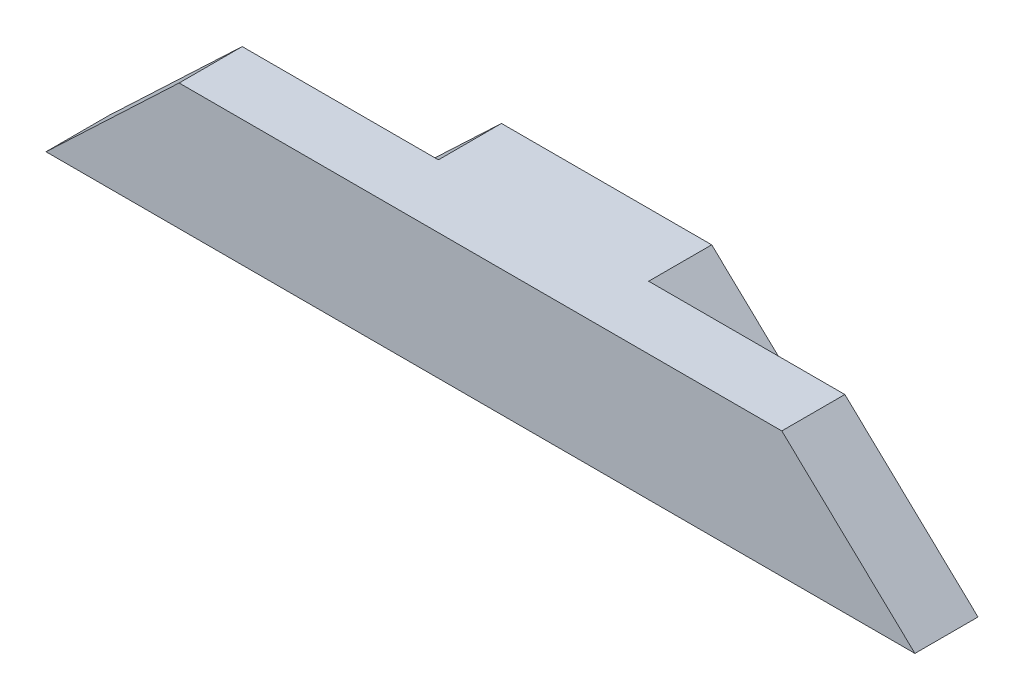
ISO-10303-21;
HEADER;
FILE_DESCRIPTION(('STEP AP214'),'2;1');
FILE_NAME('part.step','',(''),(''),'','','');
FILE_SCHEMA(('AUTOMOTIVE_DESIGN { 1 0 10303 214 1 1 1 1 }'));
ENDSEC;
DATA;
#1=APPLICATION_CONTEXT('core data for automotive mechanical design processes');
#2=APPLICATION_PROTOCOL_DEFINITION('international standard','automotive_design',2000,#1);
#3=PRODUCT_CONTEXT('',#1,'mechanical');
#4=PRODUCT('Part','Part','',(#3));
#5=PRODUCT_RELATED_PRODUCT_CATEGORY('part','',(#4));
#6=PRODUCT_DEFINITION_FORMATION('','',#4);
#7=PRODUCT_DEFINITION_CONTEXT('part definition',#1,'design');
#8=PRODUCT_DEFINITION('design','',#6,#7);
#9=PRODUCT_DEFINITION_SHAPE('','',#8);
#10=(LENGTH_UNIT() NAMED_UNIT(*) SI_UNIT(.MILLI.,.METRE.));
#11=(NAMED_UNIT(*) PLANE_ANGLE_UNIT() SI_UNIT($,.RADIAN.));
#12=(NAMED_UNIT(*) SI_UNIT($,.STERADIAN.) SOLID_ANGLE_UNIT());
#13=UNCERTAINTY_MEASURE_WITH_UNIT(LENGTH_MEASURE(1.E-05),#10,'distance_accuracy_value','');
#14=(GEOMETRIC_REPRESENTATION_CONTEXT(3) GLOBAL_UNCERTAINTY_ASSIGNED_CONTEXT((#13)) GLOBAL_UNIT_ASSIGNED_CONTEXT((#10,
#11,#12)) REPRESENTATION_CONTEXT('',''));
#15=CARTESIAN_POINT('',(0.,0.,0.));
#16=DIRECTION('',(0.,0.,1.));
#17=DIRECTION('',(1.,0.,0.));
#18=AXIS2_PLACEMENT_3D('',#15,#16,#17);
#19=CARTESIAN_POINT('',(9.5,9.,0.));
#20=DIRECTION('',(0.687744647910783,-0.725952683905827,0.));
#21=DIRECTION('',(0.725952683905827,0.687744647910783,0.));
#22=AXIS2_PLACEMENT_3D('',#19,#20,#21);
#23=PLANE('',#22);
#24=DIRECTION('',(0.725952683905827,0.687744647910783,0.));
#25=VECTOR('',#24,1.);
#26=CARTESIAN_POINT('',(0.,0.,4.5));
#27=LINE('',#26,#25);
#28=CARTESIAN_POINT('',(0.,0.,4.5));
#29=VERTEX_POINT('',#28);
#30=CARTESIAN_POINT('',(9.5,9.,4.5));
#31=VERTEX_POINT('',#30);
#32=EDGE_CURVE('E142',#29,#31,#27,.T.);
#33=ORIENTED_EDGE('',*,*,#32,.F.);
#34=DIRECTION('',(0.,0.,-1.));
#35=VECTOR('',#34,1.);
#36=CARTESIAN_POINT('',(0.,0.,9.));
#37=LINE('',#36,#35);
#38=CARTESIAN_POINT('',(0.,0.,9.));
#39=VERTEX_POINT('',#38);
#40=EDGE_CURVE('E11',#39,#29,#37,.T.);
#41=ORIENTED_EDGE('',*,*,#40,.F.);
#42=DIRECTION('',(0.725952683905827,0.687744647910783,0.));
#43=VECTOR('',#42,1.);
#44=CARTESIAN_POINT('',(9.5,9.,9.));
#45=LINE('',#44,#43);
#46=CARTESIAN_POINT('',(9.5,9.,9.));
#47=VERTEX_POINT('',#46);
#48=EDGE_CURVE('E131',#39,#47,#45,.T.);
#49=ORIENTED_EDGE('',*,*,#48,.T.);
#50=DIRECTION('',(0.,0.,1.));
#51=VECTOR('',#50,1.);
#52=CARTESIAN_POINT('',(9.5,9.,0.));
#53=LINE('',#52,#51);
#54=EDGE_CURVE('E129',#31,#47,#53,.T.);
#55=ORIENTED_EDGE('',*,*,#54,.F.);
#56=EDGE_LOOP('',(#33,#41,#49,#55));
#57=FACE_BOUND('',#56,.T.);
#58=ADVANCED_FACE('F30',(#57),#23,.F.);
#59=CARTESIAN_POINT('',(0.,0.,9.));
#60=DIRECTION('',(0.,1.,0.));
#61=DIRECTION('',(0.,0.,1.));
#62=AXIS2_PLACEMENT_3D('',#59,#60,#61);
#63=PLANE('',#62);
#64=DIRECTION('',(1.,0.,0.));
#65=VECTOR('',#64,1.);
#66=CARTESIAN_POINT('',(0.,0.,0.));
#67=LINE('',#66,#65);
#68=CARTESIAN_POINT('',(14.,0.,0.));
#69=VERTEX_POINT('',#68);
#70=CARTESIAN_POINT('',(48.,0.,0.));
#71=VERTEX_POINT('',#70);
#72=EDGE_CURVE('E123',#69,#71,#67,.T.);
#73=ORIENTED_EDGE('',*,*,#72,.T.);
#74=DIRECTION('',(0.,0.,-1.));
#75=VECTOR('',#74,1.);
#76=CARTESIAN_POINT('',(48.,0.,4.5));
#77=LINE('',#76,#75);
#78=CARTESIAN_POINT('',(48.,0.,4.5));
#79=VERTEX_POINT('',#78);
#80=EDGE_CURVE('E109',#79,#71,#77,.T.);
#81=ORIENTED_EDGE('',*,*,#80,.F.);
#82=DIRECTION('',(-1.,0.,0.));
#83=VECTOR('',#82,1.);
#84=CARTESIAN_POINT('',(48.,0.,4.5));
#85=LINE('',#84,#83);
#86=CARTESIAN_POINT('',(62.,0.,4.5));
#87=VERTEX_POINT('',#86);
#88=EDGE_CURVE('E98',#87,#79,#85,.T.);
#89=ORIENTED_EDGE('',*,*,#88,.F.);
#90=DIRECTION('',(0.,0.,-1.));
#91=VECTOR('',#90,1.);
#92=CARTESIAN_POINT('',(62.,0.,9.));
#93=LINE('',#92,#91);
#94=CARTESIAN_POINT('',(62.,0.,9.));
#95=VERTEX_POINT('',#94);
#96=EDGE_CURVE('E38',#95,#87,#93,.T.);
#97=ORIENTED_EDGE('',*,*,#96,.F.);
#98=DIRECTION('',(1.,0.,0.));
#99=VECTOR('',#98,1.);
#100=CARTESIAN_POINT('',(0.,0.,9.));
#101=LINE('',#100,#99);
#102=EDGE_CURVE('E118',#39,#95,#101,.T.);
#103=ORIENTED_EDGE('',*,*,#102,.F.);
#104=ORIENTED_EDGE('',*,*,#40,.T.);
#105=DIRECTION('',(-1.,0.,0.));
#106=VECTOR('',#105,1.);
#107=CARTESIAN_POINT('',(14.,0.,4.5));
#108=LINE('',#107,#106);
#109=CARTESIAN_POINT('',(14.,0.,4.5));
#110=VERTEX_POINT('',#109);
#111=EDGE_CURVE('E53',#110,#29,#108,.T.);
#112=ORIENTED_EDGE('',*,*,#111,.F.);
#113=DIRECTION('',(0.,0.,-1.));
#114=VECTOR('',#113,1.);
#115=CARTESIAN_POINT('',(14.,0.,4.5));
#116=LINE('',#115,#114);
#117=EDGE_CURVE('E134',#110,#69,#116,.T.);
#118=ORIENTED_EDGE('',*,*,#117,.T.);
#119=EDGE_LOOP('',(#73,#81,#89,#97,#103,#104,#112,#118));
#120=FACE_BOUND('',#119,.T.);
#121=ADVANCED_FACE('F32',(#120),#63,.F.);
#122=CARTESIAN_POINT('',(0.,9.,9.));
#123=DIRECTION('',(0.,-1.,0.));
#124=DIRECTION('',(0.,0.,-1.));
#125=AXIS2_PLACEMENT_3D('',#122,#123,#124);
#126=PLANE('',#125);
#127=DIRECTION('',(1.,0.,0.));
#128=VECTOR('',#127,1.);
#129=CARTESIAN_POINT('',(52.5,9.,4.5));
#130=LINE('',#129,#128);
#131=CARTESIAN_POINT('',(38.5,9.,4.5));
#132=VERTEX_POINT('',#131);
#133=CARTESIAN_POINT('',(52.5,9.,4.5));
#134=VERTEX_POINT('',#133);
#135=EDGE_CURVE('E45',#132,#134,#130,.T.);
#136=ORIENTED_EDGE('',*,*,#135,.F.);
#137=DIRECTION('',(0.,0.,-1.));
#138=VECTOR('',#137,1.);
#139=CARTESIAN_POINT('',(38.5,9.,4.5));
#140=LINE('',#139,#138);
#141=CARTESIAN_POINT('',(38.5,9.,0.));
#142=VERTEX_POINT('',#141);
#143=EDGE_CURVE('E143',#132,#142,#140,.T.);
#144=ORIENTED_EDGE('',*,*,#143,.T.);
#145=DIRECTION('',(-1.,0.,0.));
#146=VECTOR('',#145,1.);
#147=CARTESIAN_POINT('',(0.,9.,0.));
#148=LINE('',#147,#146);
#149=CARTESIAN_POINT('',(23.5,9.,0.));
#150=VERTEX_POINT('',#149);
#151=EDGE_CURVE('E121',#142,#150,#148,.T.);
#152=ORIENTED_EDGE('',*,*,#151,.T.);
#153=DIRECTION('',(0.,0.,-1.));
#154=VECTOR('',#153,1.);
#155=CARTESIAN_POINT('',(23.5,9.,4.5));
#156=LINE('',#155,#154);
#157=CARTESIAN_POINT('',(23.5,9.,4.5));
#158=VERTEX_POINT('',#157);
#159=EDGE_CURVE('E135',#158,#150,#156,.T.);
#160=ORIENTED_EDGE('',*,*,#159,.F.);
#161=DIRECTION('',(1.,0.,0.));
#162=VECTOR('',#161,1.);
#163=CARTESIAN_POINT('',(9.5,9.,4.5));
#164=LINE('',#163,#162);
#165=EDGE_CURVE('E147',#31,#158,#164,.T.);
#166=ORIENTED_EDGE('',*,*,#165,.F.);
#167=ORIENTED_EDGE('',*,*,#54,.T.);
#168=DIRECTION('',(-1.,0.,0.));
#169=VECTOR('',#168,1.);
#170=CARTESIAN_POINT('',(0.,9.,9.));
#171=LINE('',#170,#169);
#172=CARTESIAN_POINT('',(52.5,9.,9.));
#173=VERTEX_POINT('',#172);
#174=EDGE_CURVE('E116',#173,#47,#171,.T.);
#175=ORIENTED_EDGE('',*,*,#174,.F.);
#176=DIRECTION('',(0.,0.,1.));
#177=VECTOR('',#176,1.);
#178=CARTESIAN_POINT('',(52.5,9.,0.));
#179=LINE('',#178,#177);
#180=EDGE_CURVE('E124',#134,#173,#179,.T.);
#181=ORIENTED_EDGE('',*,*,#180,.F.);
#182=EDGE_LOOP('',(#136,#144,#152,#160,#166,#167,#175,#181));
#183=FACE_BOUND('',#182,.T.);
#184=ADVANCED_FACE('F158',(#183),#126,.F.);
#185=CARTESIAN_POINT('',(0.,9.,9.));
#186=DIRECTION('',(0.,0.,-1.));
#187=DIRECTION('',(-1.,0.,0.));
#188=AXIS2_PLACEMENT_3D('',#185,#186,#187);
#189=PLANE('',#188);
#190=ORIENTED_EDGE('',*,*,#174,.T.);
#191=ORIENTED_EDGE('',*,*,#48,.F.);
#192=ORIENTED_EDGE('',*,*,#102,.T.);
#193=DIRECTION('',(0.725952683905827,-0.687744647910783,0.));
#194=VECTOR('',#193,1.);
#195=CARTESIAN_POINT('',(52.5,9.,9.));
#196=LINE('',#195,#194);
#197=EDGE_CURVE('E114',#173,#95,#196,.T.);
#198=ORIENTED_EDGE('',*,*,#197,.F.);
#199=EDGE_LOOP('',(#190,#191,#192,#198));
#200=FACE_BOUND('',#199,.T.);
#201=ADVANCED_FACE('F162',(#200),#189,.F.);
#202=CARTESIAN_POINT('',(0.,9.,0.));
#203=DIRECTION('',(0.,0.,-1.));
#204=DIRECTION('',(-1.,0.,0.));
#205=AXIS2_PLACEMENT_3D('',#202,#203,#204);
#206=PLANE('',#205);
#207=DIRECTION('',(-0.725952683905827,0.687744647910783,0.));
#208=VECTOR('',#207,1.);
#209=CARTESIAN_POINT('',(38.5,9.,0.));
#210=LINE('',#209,#208);
#211=EDGE_CURVE('E103',#71,#142,#210,.T.);
#212=ORIENTED_EDGE('',*,*,#211,.F.);
#213=ORIENTED_EDGE('',*,*,#72,.F.);
#214=DIRECTION('',(-0.725952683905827,-0.687744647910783,0.));
#215=VECTOR('',#214,1.);
#216=CARTESIAN_POINT('',(23.5,9.,0.));
#217=LINE('',#216,#215);
#218=EDGE_CURVE('E140',#150,#69,#217,.T.);
#219=ORIENTED_EDGE('',*,*,#218,.F.);
#220=ORIENTED_EDGE('',*,*,#151,.F.);
#221=EDGE_LOOP('',(#212,#213,#219,#220));
#222=FACE_BOUND('',#221,.T.);
#223=ADVANCED_FACE('F175',(#222),#206,.T.);
#224=CARTESIAN_POINT('',(52.5,9.,0.));
#225=DIRECTION('',(-0.687744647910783,-0.725952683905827,0.));
#226=DIRECTION('',(0.725952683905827,-0.687744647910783,0.));
#227=AXIS2_PLACEMENT_3D('',#224,#225,#226);
#228=PLANE('',#227);
#229=ORIENTED_EDGE('',*,*,#96,.T.);
#230=DIRECTION('',(0.725952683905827,-0.687744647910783,0.));
#231=VECTOR('',#230,1.);
#232=CARTESIAN_POINT('',(62.,0.,4.5));
#233=LINE('',#232,#231);
#234=EDGE_CURVE('E95',#134,#87,#233,.T.);
#235=ORIENTED_EDGE('',*,*,#234,.F.);
#236=ORIENTED_EDGE('',*,*,#180,.T.);
#237=ORIENTED_EDGE('',*,*,#197,.T.);
#238=EDGE_LOOP('',(#229,#235,#236,#237));
#239=FACE_BOUND('',#238,.T.);
#240=ADVANCED_FACE('F112',(#239),#228,.F.);
#241=CARTESIAN_POINT('',(23.5,9.,4.5));
#242=DIRECTION('',(0.687744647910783,-0.725952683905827,0.));
#243=DIRECTION('',(0.725952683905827,0.687744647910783,0.));
#244=AXIS2_PLACEMENT_3D('',#241,#242,#243);
#245=PLANE('',#244);
#246=ORIENTED_EDGE('',*,*,#218,.T.);
#247=ORIENTED_EDGE('',*,*,#117,.F.);
#248=DIRECTION('',(-0.725952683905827,-0.687744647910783,0.));
#249=VECTOR('',#248,1.);
#250=CARTESIAN_POINT('',(23.5,9.,4.5));
#251=LINE('',#250,#249);
#252=EDGE_CURVE('E145',#158,#110,#251,.T.);
#253=ORIENTED_EDGE('',*,*,#252,.F.);
#254=ORIENTED_EDGE('',*,*,#159,.T.);
#255=EDGE_LOOP('',(#246,#247,#253,#254));
#256=FACE_BOUND('',#255,.T.);
#257=ADVANCED_FACE('F171',(#256),#245,.F.);
#258=CARTESIAN_POINT('',(9.50000000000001,9.,4.5));
#259=DIRECTION('',(0.,0.,-1.));
#260=DIRECTION('',(-1.,0.,0.));
#261=AXIS2_PLACEMENT_3D('',#258,#259,#260);
#262=PLANE('',#261);
#263=ORIENTED_EDGE('',*,*,#32,.T.);
#264=ORIENTED_EDGE('',*,*,#165,.T.);
#265=ORIENTED_EDGE('',*,*,#252,.T.);
#266=ORIENTED_EDGE('',*,*,#111,.T.);
#267=EDGE_LOOP('',(#263,#264,#265,#266));
#268=FACE_BOUND('',#267,.T.);
#269=ADVANCED_FACE('F167',(#268),#262,.T.);
#270=CARTESIAN_POINT('',(38.5,9.,4.5));
#271=DIRECTION('',(-0.687744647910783,-0.725952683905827,0.));
#272=DIRECTION('',(0.725952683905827,-0.687744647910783,0.));
#273=AXIS2_PLACEMENT_3D('',#270,#271,#272);
#274=PLANE('',#273);
#275=ORIENTED_EDGE('',*,*,#211,.T.);
#276=ORIENTED_EDGE('',*,*,#143,.F.);
#277=DIRECTION('',(-0.725952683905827,0.687744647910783,0.));
#278=VECTOR('',#277,1.);
#279=CARTESIAN_POINT('',(38.5,9.,4.5));
#280=LINE('',#279,#278);
#281=EDGE_CURVE('E110',#79,#132,#280,.T.);
#282=ORIENTED_EDGE('',*,*,#281,.F.);
#283=ORIENTED_EDGE('',*,*,#80,.T.);
#284=EDGE_LOOP('',(#275,#276,#282,#283));
#285=FACE_BOUND('',#284,.T.);
#286=ADVANCED_FACE('F176',(#285),#274,.F.);
#287=CARTESIAN_POINT('',(52.5,9.,4.5));
#288=DIRECTION('',(0.,0.,1.));
#289=DIRECTION('',(1.,0.,0.));
#290=AXIS2_PLACEMENT_3D('',#287,#288,#289);
#291=PLANE('',#290);
#292=ORIENTED_EDGE('',*,*,#234,.T.);
#293=ORIENTED_EDGE('',*,*,#88,.T.);
#294=ORIENTED_EDGE('',*,*,#281,.T.);
#295=ORIENTED_EDGE('',*,*,#135,.T.);
#296=EDGE_LOOP('',(#292,#293,#294,#295));
#297=FACE_BOUND('',#296,.T.);
#298=ADVANCED_FACE('F97',(#297),#291,.F.);
#299=CLOSED_SHELL('',(#58,#121,#184,#201,#223,#240,#257,#269,#286,#298));
#300=MANIFOLD_SOLID_BREP('B2',#299);
#301=ADVANCED_BREP_SHAPE_REPRESENTATION('',(#18,#300),#14);
#302=SHAPE_DEFINITION_REPRESENTATION(#9,#301);
ENDSEC;
END-ISO-10303-21;
